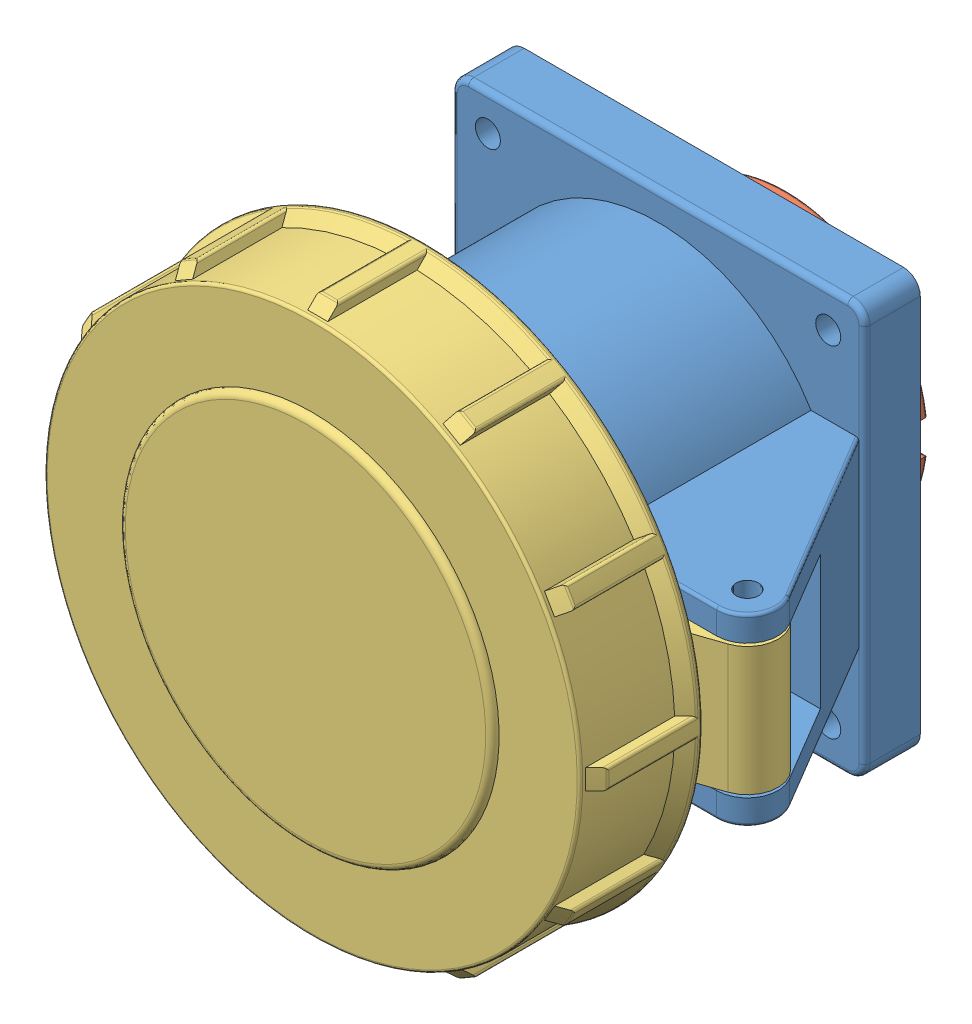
SolidWorks assembly Розетка стационарная внутренняя ps-3252-32-380.SLDASM, configuration По умолчанию (file format 10000). Lengths in mm.
Overall size (105 100 96.2).
3 component instances, 3 part files, 6 mates.
Components (placement in the parent):
- Корпус 3252-1: Корпус 3252.SLDPRT [По умолчанию] at (-38.8422 1.7999 -2.2574) size (92.42 74 61.04)
- Колодка 3252,4252-1: Колодка 3252,4252.SLDPRT [По умолчанию] at (-38.8422 1.7999 -15.2574) size (51 51 32)
- Крышка 3242,3252,4242,4252-1: Крышка 3242,3252,4242,4252.SLDPRT [По умолчанию] at (-38.8422 1.7999 69.7426) x (0 1 0) z (0 0 -1) size (100 105 35.2)
Mates (geometry in assembly coordinates):
- Концентричный1: concentric aligned: cylinder of Корпус 3252-1 through (-38.8422 1.7999 6.7426) axis (0 0 -1) radius 27; cylinder of Колодка 3252,4252-1 through (-38.8422 1.7999 6.7426) axis (0 0 -1) radius 25.5
- Параллельность1: parallel aligned: plane of Корпус 3252-1 through (10.6578 18.2999 41.2426) normal (0 1 0); plane of Колодка 3252,4252-1 through (-1.8422 -1.2001 -8.2574) normal (0 1 0)
- Совпадение1: coincident anti-aligned: plane of Корпус 3252-1 through (-38.8422 1.7999 6.7426) normal (0 0 -1); plane of Колодка 3252,4252-1 through (-38.8422 1.7999 6.7426) normal (0 0 1)
- Концентричный2: concentric aligned: cylinder of Корпус 3252-1 through (-38.8422 1.7999 58.7426) axis (0 0 -1) radius 32; cylinder of Крышка 3242,3252,4242,4252-1 through (-38.8422 1.7999 58.7426) axis (0 0 -1) radius 45
- Параллельность2: parallel aligned: plane of Корпус 3252-1 through (10.6578 -14.7001 41.2426) normal (0 -1 0); plane of Крышка 3242,3252,4242,4252-1 through (2.6477 -9.7001 47.665) normal (0 -1 0)
- Совпадение2: coincident anti-aligned: plane of Корпус 3252-1 through (-38.8422 1.7999 58.7426) normal (0 0 1); plane of Крышка 3242,3252,4242,4252-1 through (-38.8422 1.7999 58.7426) normal (0 0 -1)
